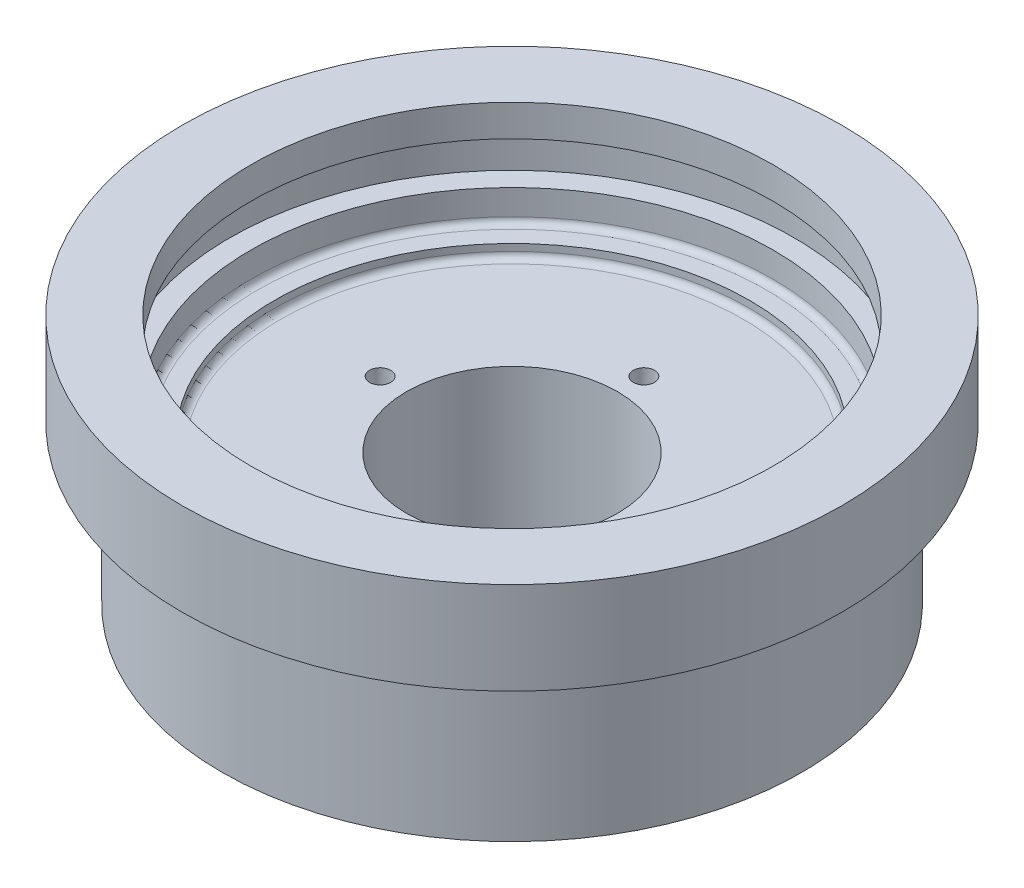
ISO-10303-21;
HEADER;
FILE_DESCRIPTION(('STEP AP214'),'2;1');
FILE_NAME('part.step','',(''),(''),'','','');
FILE_SCHEMA(('AUTOMOTIVE_DESIGN { 1 0 10303 214 1 1 1 1 }'));
ENDSEC;
DATA;
#1=APPLICATION_CONTEXT('core data for automotive mechanical design processes');
#2=APPLICATION_PROTOCOL_DEFINITION('international standard','automotive_design',2000,#1);
#3=PRODUCT_CONTEXT('',#1,'mechanical');
#4=PRODUCT('Part','Part','',(#3));
#5=PRODUCT_RELATED_PRODUCT_CATEGORY('part','',(#4));
#6=PRODUCT_DEFINITION_FORMATION('','',#4);
#7=PRODUCT_DEFINITION_CONTEXT('part definition',#1,'design');
#8=PRODUCT_DEFINITION('design','',#6,#7);
#9=PRODUCT_DEFINITION_SHAPE('','',#8);
#10=(LENGTH_UNIT() NAMED_UNIT(*) SI_UNIT(.MILLI.,.METRE.));
#11=(NAMED_UNIT(*) PLANE_ANGLE_UNIT() SI_UNIT($,.RADIAN.));
#12=(NAMED_UNIT(*) SI_UNIT($,.STERADIAN.) SOLID_ANGLE_UNIT());
#13=UNCERTAINTY_MEASURE_WITH_UNIT(LENGTH_MEASURE(1.E-05),#10,'distance_accuracy_value','');
#14=(GEOMETRIC_REPRESENTATION_CONTEXT(3) GLOBAL_UNCERTAINTY_ASSIGNED_CONTEXT((#13)) GLOBAL_UNIT_ASSIGNED_CONTEXT((#10,
#11,#12)) REPRESENTATION_CONTEXT('',''));
#15=CARTESIAN_POINT('',(0.,0.,0.));
#16=DIRECTION('',(0.,0.,1.));
#17=DIRECTION('',(1.,0.,0.));
#18=AXIS2_PLACEMENT_3D('',#15,#16,#17);
#19=CARTESIAN_POINT('',(0.,88.7095,0.));
#20=DIRECTION('',(0.,1.,0.));
#21=DIRECTION('',(0.,0.,1.));
#22=AXIS2_PLACEMENT_3D('',#19,#20,#21);
#23=CYLINDRICAL_SURFACE('',#22,62.865);
#24=CARTESIAN_POINT('',(0.,0.,0.));
#25=DIRECTION('',(0.,1.,0.));
#26=DIRECTION('',(0.,0.,1.));
#27=AXIS2_PLACEMENT_3D('',#24,#25,#26);
#28=CIRCLE('',#27,62.865);
#29=CARTESIAN_POINT('',(0.,0.,62.865));
#30=VERTEX_POINT('',#29);
#31=EDGE_CURVE('E12',#30,#30,#28,.T.);
#32=ORIENTED_EDGE('',*,*,#31,.T.);
#33=EDGE_LOOP('',(#32));
#34=FACE_BOUND('',#33,.T.);
#35=CARTESIAN_POINT('',(0.,-7.62,0.));
#36=DIRECTION('',(0.,1.,0.));
#37=DIRECTION('',(0.,0.,1.));
#38=AXIS2_PLACEMENT_3D('',#35,#36,#37);
#39=CIRCLE('',#38,62.865);
#40=CARTESIAN_POINT('',(0.,-7.62,62.865));
#41=VERTEX_POINT('',#40);
#42=EDGE_CURVE('E145',#41,#41,#39,.T.);
#43=ORIENTED_EDGE('',*,*,#42,.F.);
#44=EDGE_LOOP('',(#43));
#45=FACE_BOUND('',#44,.T.);
#46=ADVANCED_FACE('F45',(#34,#45),#23,.F.);
#47=CARTESIAN_POINT('',(62.865,0.,0.));
#48=DIRECTION('',(0.,1.,0.));
#49=DIRECTION('',(0.,0.,1.));
#50=AXIS2_PLACEMENT_3D('',#47,#48,#49);
#51=PLANE('',#50);
#52=CARTESIAN_POINT('',(0.,0.,0.));
#53=DIRECTION('',(0.,1.,0.));
#54=DIRECTION('',(0.,0.,1.));
#55=AXIS2_PLACEMENT_3D('',#52,#53,#54);
#56=CIRCLE('',#55,79.375);
#57=CARTESIAN_POINT('',(0.,0.,79.375));
#58=VERTEX_POINT('',#57);
#59=EDGE_CURVE('E52',#58,#58,#56,.T.);
#60=ORIENTED_EDGE('',*,*,#59,.T.);
#61=EDGE_LOOP('',(#60));
#62=FACE_BOUND('',#61,.T.);
#63=ORIENTED_EDGE('',*,*,#31,.F.);
#64=EDGE_LOOP('',(#63));
#65=FACE_BOUND('',#64,.T.);
#66=ADVANCED_FACE('F222',(#62,#65),#51,.T.);
#67=CARTESIAN_POINT('',(0.,88.7095,0.));
#68=DIRECTION('',(0.,1.,0.));
#69=DIRECTION('',(0.,0.,1.));
#70=AXIS2_PLACEMENT_3D('',#67,#68,#69);
#71=CYLINDRICAL_SURFACE('',#70,79.375);
#72=CARTESIAN_POINT('',(0.,-22.225,0.));
#73=DIRECTION('',(0.,1.,0.));
#74=DIRECTION('',(0.,0.,1.));
#75=AXIS2_PLACEMENT_3D('',#72,#73,#74);
#76=CIRCLE('',#75,79.375);
#77=CARTESIAN_POINT('',(0.,-22.225,79.375));
#78=VERTEX_POINT('',#77);
#79=EDGE_CURVE('E59',#78,#78,#76,.T.);
#80=ORIENTED_EDGE('',*,*,#79,.T.);
#81=EDGE_LOOP('',(#80));
#82=FACE_BOUND('',#81,.T.);
#83=ORIENTED_EDGE('',*,*,#59,.F.);
#84=EDGE_LOOP('',(#83));
#85=FACE_BOUND('',#84,.T.);
#86=ADVANCED_FACE('F226',(#82,#85),#71,.T.);
#87=CARTESIAN_POINT('',(79.375,-22.225,0.));
#88=DIRECTION('',(0.,-1.,0.));
#89=DIRECTION('',(0.,0.,-1.));
#90=AXIS2_PLACEMENT_3D('',#87,#88,#89);
#91=PLANE('',#90);
#92=CARTESIAN_POINT('',(0.,-22.225,0.));
#93=DIRECTION('',(0.,1.,0.));
#94=DIRECTION('',(0.,0.,1.));
#95=AXIS2_PLACEMENT_3D('',#92,#93,#94);
#96=CIRCLE('',#95,71.374);
#97=CARTESIAN_POINT('',(0.,-22.225,71.374));
#98=VERTEX_POINT('',#97);
#99=EDGE_CURVE('E66',#98,#98,#96,.T.);
#100=ORIENTED_EDGE('',*,*,#99,.T.);
#101=EDGE_LOOP('',(#100));
#102=FACE_BOUND('',#101,.T.);
#103=ORIENTED_EDGE('',*,*,#79,.F.);
#104=EDGE_LOOP('',(#103));
#105=FACE_BOUND('',#104,.T.);
#106=ADVANCED_FACE('F294',(#102,#105),#91,.T.);
#107=CARTESIAN_POINT('',(0.,-23.749,0.));
#108=DIRECTION('',(0.,1.,0.));
#109=DIRECTION('',(0.,0.,1.));
#110=AXIS2_PLACEMENT_3D('',#107,#108,#109);
#111=TOROIDAL_SURFACE('',#110,71.374,1.524);
#112=ORIENTED_EDGE('',*,*,#99,.F.);
#113=EDGE_LOOP('',(#112));
#114=FACE_BOUND('',#113,.T.);
#115=CARTESIAN_POINT('',(0.,-23.749,0.));
#116=DIRECTION('',(0.,1.,0.));
#117=DIRECTION('',(0.,0.,1.));
#118=AXIS2_PLACEMENT_3D('',#115,#116,#117);
#119=CIRCLE('',#118,69.85);
#120=CARTESIAN_POINT('',(0.,-23.749,69.85));
#121=VERTEX_POINT('',#120);
#122=EDGE_CURVE('E72',#121,#121,#119,.T.);
#123=ORIENTED_EDGE('',*,*,#122,.T.);
#124=EDGE_LOOP('',(#123));
#125=FACE_BOUND('',#124,.T.);
#126=ADVANCED_FACE('F328',(#114,#125),#111,.F.);
#127=CARTESIAN_POINT('',(0.,88.7095,0.));
#128=DIRECTION('',(0.,1.,0.));
#129=DIRECTION('',(0.,0.,1.));
#130=AXIS2_PLACEMENT_3D('',#127,#128,#129);
#131=CYLINDRICAL_SURFACE('',#130,69.85);
#132=CARTESIAN_POINT('',(0.,-60.325,0.));
#133=DIRECTION('',(0.,1.,0.));
#134=DIRECTION('',(0.,0.,1.));
#135=AXIS2_PLACEMENT_3D('',#132,#133,#134);
#136=CIRCLE('',#135,69.85);
#137=CARTESIAN_POINT('',(0.,-60.325,69.85));
#138=VERTEX_POINT('',#137);
#139=EDGE_CURVE('E76',#138,#138,#136,.T.);
#140=ORIENTED_EDGE('',*,*,#139,.T.);
#141=EDGE_LOOP('',(#140));
#142=FACE_BOUND('',#141,.T.);
#143=ORIENTED_EDGE('',*,*,#122,.F.);
#144=EDGE_LOOP('',(#143));
#145=FACE_BOUND('',#144,.T.);
#146=ADVANCED_FACE('F319',(#142,#145),#131,.T.);
#147=CARTESIAN_POINT('',(64.5159999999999,-60.325,0.));
#148=DIRECTION('',(0.,1.,0.));
#149=DIRECTION('',(0.,0.,1.));
#150=AXIS2_PLACEMENT_3D('',#147,#148,#149);
#151=PLANE('',#150);
#152=ORIENTED_EDGE('',*,*,#139,.F.);
#153=EDGE_LOOP('',(#152));
#154=FACE_BOUND('',#153,.T.);
#155=CARTESIAN_POINT('',(0.,-60.325,0.));
#156=DIRECTION('',(0.,1.,0.));
#157=DIRECTION('',(0.,0.,1.));
#158=AXIS2_PLACEMENT_3D('',#155,#156,#157);
#159=CIRCLE('',#158,64.5159999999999);
#160=CARTESIAN_POINT('',(0.,-60.325,64.5159999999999));
#161=VERTEX_POINT('',#160);
#162=EDGE_CURVE('E80',#161,#161,#159,.T.);
#163=ORIENTED_EDGE('',*,*,#162,.T.);
#164=EDGE_LOOP('',(#163));
#165=FACE_BOUND('',#164,.T.);
#166=ADVANCED_FACE('F308',(#154,#165),#151,.F.);
#167=CARTESIAN_POINT('',(0.,-61.849,0.));
#168=DIRECTION('',(0.,1.,0.));
#169=DIRECTION('',(0.,0.,1.));
#170=AXIS2_PLACEMENT_3D('',#167,#168,#169);
#171=TOROIDAL_SURFACE('',#170,64.5159999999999,1.52399999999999);
#172=CARTESIAN_POINT('',(0.,-61.849,0.));
#173=DIRECTION('',(0.,1.,0.));
#174=DIRECTION('',(0.,0.,1.));
#175=AXIS2_PLACEMENT_3D('',#172,#173,#174);
#176=CIRCLE('',#175,62.992);
#177=CARTESIAN_POINT('',(0.,-61.849,62.992));
#178=VERTEX_POINT('',#177);
#179=EDGE_CURVE('E84',#178,#178,#176,.T.);
#180=ORIENTED_EDGE('',*,*,#179,.T.);
#181=EDGE_LOOP('',(#180));
#182=FACE_BOUND('',#181,.T.);
#183=ORIENTED_EDGE('',*,*,#162,.F.);
#184=EDGE_LOOP('',(#183));
#185=FACE_BOUND('',#184,.T.);
#186=ADVANCED_FACE('F303',(#182,#185),#171,.F.);
#187=CARTESIAN_POINT('',(0.,88.7095,0.));
#188=DIRECTION('',(0.,1.,0.));
#189=DIRECTION('',(0.,0.,1.));
#190=AXIS2_PLACEMENT_3D('',#187,#188,#189);
#191=CYLINDRICAL_SURFACE('',#190,62.992);
#192=ORIENTED_EDGE('',*,*,#179,.F.);
#193=EDGE_LOOP('',(#192));
#194=FACE_BOUND('',#193,.T.);
#195=CARTESIAN_POINT('',(0.,-63.5,0.));
#196=DIRECTION('',(0.,1.,0.));
#197=DIRECTION('',(0.,0.,1.));
#198=AXIS2_PLACEMENT_3D('',#195,#196,#197);
#199=CIRCLE('',#198,62.9919999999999);
#200=CARTESIAN_POINT('',(0.,-63.5,62.9919999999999));
#201=VERTEX_POINT('',#200);
#202=EDGE_CURVE('E88',#201,#201,#199,.T.);
#203=ORIENTED_EDGE('',*,*,#202,.T.);
#204=EDGE_LOOP('',(#203));
#205=FACE_BOUND('',#204,.T.);
#206=ADVANCED_FACE('F307',(#194,#205),#191,.T.);
#207=CARTESIAN_POINT('',(41.275,-63.5,0.));
#208=DIRECTION('',(0.,1.,0.));
#209=DIRECTION('',(0.,0.,1.));
#210=AXIS2_PLACEMENT_3D('',#207,#208,#209);
#211=PLANE('',#210);
#212=ORIENTED_EDGE('',*,*,#202,.F.);
#213=EDGE_LOOP('',(#212));
#214=FACE_BOUND('',#213,.T.);
#215=CARTESIAN_POINT('',(0.,-63.5,0.));
#216=DIRECTION('',(0.,1.,0.));
#217=DIRECTION('',(0.,0.,1.));
#218=AXIS2_PLACEMENT_3D('',#215,#216,#217);
#219=CIRCLE('',#218,41.275);
#220=CARTESIAN_POINT('',(0.,-63.5,41.275));
#221=VERTEX_POINT('',#220);
#222=EDGE_CURVE('E92',#221,#221,#219,.T.);
#223=ORIENTED_EDGE('',*,*,#222,.T.);
#224=EDGE_LOOP('',(#223));
#225=FACE_BOUND('',#224,.T.);
#226=ADVANCED_FACE('F464',(#214,#225),#211,.F.);
#227=CARTESIAN_POINT('',(0.,88.7095,0.));
#228=DIRECTION('',(0.,1.,0.));
#229=DIRECTION('',(0.,0.,1.));
#230=AXIS2_PLACEMENT_3D('',#227,#228,#229);
#231=CYLINDRICAL_SURFACE('',#230,41.275);
#232=ORIENTED_EDGE('',*,*,#222,.F.);
#233=EDGE_LOOP('',(#232));
#234=FACE_BOUND('',#233,.T.);
#235=CARTESIAN_POINT('',(0.,-60.6806,0.));
#236=DIRECTION('',(0.,1.,0.));
#237=DIRECTION('',(0.,0.,1.));
#238=AXIS2_PLACEMENT_3D('',#235,#236,#237);
#239=CIRCLE('',#238,41.275);
#240=CARTESIAN_POINT('',(0.,-60.6806,41.275));
#241=VERTEX_POINT('',#240);
#242=EDGE_CURVE('E95',#241,#241,#239,.T.);
#243=ORIENTED_EDGE('',*,*,#242,.T.);
#244=EDGE_LOOP('',(#243));
#245=FACE_BOUND('',#244,.T.);
#246=ADVANCED_FACE('F355',(#234,#245),#231,.F.);
#247=CARTESIAN_POINT('',(36.5252,-60.6806,0.));
#248=DIRECTION('',(0.,1.,0.));
#249=DIRECTION('',(0.,0.,1.));
#250=AXIS2_PLACEMENT_3D('',#247,#248,#249);
#251=PLANE('',#250);
#252=ORIENTED_EDGE('',*,*,#242,.F.);
#253=EDGE_LOOP('',(#252));
#254=FACE_BOUND('',#253,.T.);
#255=CARTESIAN_POINT('',(0.,-60.6806,0.));
#256=DIRECTION('',(0.,1.,0.));
#257=DIRECTION('',(0.,0.,1.));
#258=AXIS2_PLACEMENT_3D('',#255,#256,#257);
#259=CIRCLE('',#258,36.5252);
#260=CARTESIAN_POINT('',(0.,-60.6806,36.5252));
#261=VERTEX_POINT('',#260);
#262=EDGE_CURVE('E99',#261,#261,#259,.T.);
#263=ORIENTED_EDGE('',*,*,#262,.T.);
#264=EDGE_LOOP('',(#263));
#265=FACE_BOUND('',#264,.T.);
#266=ADVANCED_FACE('F218',(#254,#265),#251,.F.);
#267=CARTESIAN_POINT('',(0.,88.7095,0.));
#268=DIRECTION('',(0.,1.,0.));
#269=DIRECTION('',(0.,0.,1.));
#270=AXIS2_PLACEMENT_3D('',#267,#268,#269);
#271=CYLINDRICAL_SURFACE('',#270,36.5252);
#272=CARTESIAN_POINT('',(0.,-63.5,0.));
#273=DIRECTION('',(0.,1.,0.));
#274=DIRECTION('',(0.,0.,1.));
#275=AXIS2_PLACEMENT_3D('',#272,#273,#274);
#276=CIRCLE('',#275,36.5252);
#277=CARTESIAN_POINT('',(0.,-63.5,36.5252));
#278=VERTEX_POINT('',#277);
#279=EDGE_CURVE('E103',#278,#278,#276,.T.);
#280=ORIENTED_EDGE('',*,*,#279,.T.);
#281=EDGE_LOOP('',(#280));
#282=FACE_BOUND('',#281,.T.);
#283=ORIENTED_EDGE('',*,*,#262,.F.);
#284=EDGE_LOOP('',(#283));
#285=FACE_BOUND('',#284,.T.);
#286=ADVANCED_FACE('F213',(#282,#285),#271,.T.);
#287=CARTESIAN_POINT('',(25.4,-63.5,0.));
#288=DIRECTION('',(0.,1.,0.));
#289=DIRECTION('',(0.,0.,1.));
#290=AXIS2_PLACEMENT_3D('',#287,#288,#289);
#291=PLANE('',#290);
#292=CARTESIAN_POINT('',(31.75,-63.5,3.32563790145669E-13));
#293=DIRECTION('',(0.,1.,0.));
#294=DIRECTION('',(1.,0.,0.));
#295=AXIS2_PLACEMENT_3D('',#292,#293,#294);
#296=CIRCLE('',#295,2.54);
#297=CARTESIAN_POINT('',(34.29,-63.5,3.59168893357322E-13));
#298=VERTEX_POINT('',#297);
#299=EDGE_CURVE('E176',#298,#298,#296,.T.);
#300=ORIENTED_EDGE('',*,*,#299,.T.);
#301=EDGE_LOOP('',(#300));
#302=FACE_BOUND('',#301,.T.);
#303=CARTESIAN_POINT('',(2.21709193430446E-13,-63.5,-31.75));
#304=DIRECTION('',(0.,1.,0.));
#305=DIRECTION('',(0.,0.,-1.));
#306=AXIS2_PLACEMENT_3D('',#303,#304,#305);
#307=CIRCLE('',#306,2.54);
#308=CARTESIAN_POINT('',(2.39445928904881E-13,-63.5,-34.29));
#309=VERTEX_POINT('',#308);
#310=EDGE_CURVE('E168',#309,#309,#307,.T.);
#311=ORIENTED_EDGE('',*,*,#310,.T.);
#312=EDGE_LOOP('',(#311));
#313=FACE_BOUND('',#312,.T.);
#314=CARTESIAN_POINT('',(-31.75,-63.5,-1.10854596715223E-13));
#315=DIRECTION('',(0.,1.,0.));
#316=DIRECTION('',(-1.,0.,0.));
#317=AXIS2_PLACEMENT_3D('',#314,#315,#316);
#318=CIRCLE('',#317,2.54);
#319=CARTESIAN_POINT('',(-34.29,-63.5,-1.19722964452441E-13));
#320=VERTEX_POINT('',#319);
#321=EDGE_CURVE('E161',#320,#320,#318,.T.);
#322=ORIENTED_EDGE('',*,*,#321,.T.);
#323=EDGE_LOOP('',(#322));
#324=FACE_BOUND('',#323,.T.);
#325=CARTESIAN_POINT('',(0.,-63.5,31.75));
#326=DIRECTION('',(0.,1.,0.));
#327=DIRECTION('',(0.,0.,1.));
#328=AXIS2_PLACEMENT_3D('',#325,#326,#327);
#329=CIRCLE('',#328,2.54);
#330=CARTESIAN_POINT('',(0.,-63.5,34.29));
#331=VERTEX_POINT('',#330);
#332=EDGE_CURVE('E149',#331,#331,#329,.T.);
#333=ORIENTED_EDGE('',*,*,#332,.T.);
#334=EDGE_LOOP('',(#333));
#335=FACE_BOUND('',#334,.T.);
#336=ORIENTED_EDGE('',*,*,#279,.F.);
#337=EDGE_LOOP('',(#336));
#338=FACE_BOUND('',#337,.T.);
#339=CARTESIAN_POINT('',(0.,-63.5,0.));
#340=DIRECTION('',(0.,1.,0.));
#341=DIRECTION('',(0.,0.,1.));
#342=AXIS2_PLACEMENT_3D('',#339,#340,#341);
#343=CIRCLE('',#342,25.4);
#344=CARTESIAN_POINT('',(0.,-63.5,25.4));
#345=VERTEX_POINT('',#344);
#346=EDGE_CURVE('E107',#345,#345,#343,.T.);
#347=ORIENTED_EDGE('',*,*,#346,.T.);
#348=EDGE_LOOP('',(#347));
#349=FACE_BOUND('',#348,.T.);
#350=ADVANCED_FACE('F181',(#302,#313,#324,#335,#338,#349),#291,.F.);
#351=CARTESIAN_POINT('',(0.,88.7095,0.));
#352=DIRECTION('',(0.,1.,0.));
#353=DIRECTION('',(0.,0.,1.));
#354=AXIS2_PLACEMENT_3D('',#351,#352,#353);
#355=CYLINDRICAL_SURFACE('',#354,25.4);
#356=CARTESIAN_POINT('',(0.,-28.575,0.));
#357=DIRECTION('',(0.,1.,0.));
#358=DIRECTION('',(0.,0.,1.));
#359=AXIS2_PLACEMENT_3D('',#356,#357,#358);
#360=CIRCLE('',#359,25.4);
#361=CARTESIAN_POINT('',(0.,-28.575,25.4));
#362=VERTEX_POINT('',#361);
#363=EDGE_CURVE('E110',#362,#362,#360,.T.);
#364=ORIENTED_EDGE('',*,*,#363,.T.);
#365=EDGE_LOOP('',(#364));
#366=FACE_BOUND('',#365,.T.);
#367=ORIENTED_EDGE('',*,*,#346,.F.);
#368=EDGE_LOOP('',(#367));
#369=FACE_BOUND('',#368,.T.);
#370=ADVANCED_FACE('F195',(#366,#369),#355,.F.);
#371=CARTESIAN_POINT('',(25.4,-28.575,0.));
#372=DIRECTION('',(0.,1.,0.));
#373=DIRECTION('',(0.,0.,1.));
#374=AXIS2_PLACEMENT_3D('',#371,#372,#373);
#375=PLANE('',#374);
#376=CARTESIAN_POINT('',(31.75,-28.575,3.32563790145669E-13));
#377=DIRECTION('',(0.,1.,0.));
#378=DIRECTION('',(1.,0.,0.));
#379=AXIS2_PLACEMENT_3D('',#376,#377,#378);
#380=CIRCLE('',#379,2.54);
#381=CARTESIAN_POINT('',(34.29,-28.575,3.59168893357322E-13));
#382=VERTEX_POINT('',#381);
#383=EDGE_CURVE('E172',#382,#382,#380,.T.);
#384=ORIENTED_EDGE('',*,*,#383,.F.);
#385=EDGE_LOOP('',(#384));
#386=FACE_BOUND('',#385,.T.);
#387=CARTESIAN_POINT('',(2.21709193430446E-13,-28.575,-31.75));
#388=DIRECTION('',(0.,1.,0.));
#389=DIRECTION('',(0.,0.,-1.));
#390=AXIS2_PLACEMENT_3D('',#387,#388,#389);
#391=CIRCLE('',#390,2.54);
#392=CARTESIAN_POINT('',(2.39445928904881E-13,-28.575,-34.29));
#393=VERTEX_POINT('',#392);
#394=EDGE_CURVE('E165',#393,#393,#391,.T.);
#395=ORIENTED_EDGE('',*,*,#394,.F.);
#396=EDGE_LOOP('',(#395));
#397=FACE_BOUND('',#396,.T.);
#398=CARTESIAN_POINT('',(-31.75,-28.575,-1.10854596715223E-13));
#399=DIRECTION('',(0.,1.,0.));
#400=DIRECTION('',(-1.,0.,0.));
#401=AXIS2_PLACEMENT_3D('',#398,#399,#400);
#402=CIRCLE('',#401,2.54);
#403=CARTESIAN_POINT('',(-34.29,-28.575,-1.19722964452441E-13));
#404=VERTEX_POINT('',#403);
#405=EDGE_CURVE('E157',#404,#404,#402,.T.);
#406=ORIENTED_EDGE('',*,*,#405,.F.);
#407=EDGE_LOOP('',(#406));
#408=FACE_BOUND('',#407,.T.);
#409=CARTESIAN_POINT('',(0.,-28.575,31.75));
#410=DIRECTION('',(0.,1.,0.));
#411=DIRECTION('',(0.,0.,1.));
#412=AXIS2_PLACEMENT_3D('',#409,#410,#411);
#413=CIRCLE('',#412,2.54);
#414=CARTESIAN_POINT('',(0.,-28.575,34.29));
#415=VERTEX_POINT('',#414);
#416=EDGE_CURVE('E153',#415,#415,#413,.T.);
#417=ORIENTED_EDGE('',*,*,#416,.F.);
#418=EDGE_LOOP('',(#417));
#419=FACE_BOUND('',#418,.T.);
#420=CARTESIAN_POINT('',(0.,-28.575,0.));
#421=DIRECTION('',(0.,1.,0.));
#422=DIRECTION('',(0.,0.,1.));
#423=AXIS2_PLACEMENT_3D('',#420,#421,#422);
#424=CIRCLE('',#423,55.626);
#425=CARTESIAN_POINT('',(0.,-28.575,55.626));
#426=VERTEX_POINT('',#425);
#427=EDGE_CURVE('E114',#426,#426,#424,.T.);
#428=ORIENTED_EDGE('',*,*,#427,.T.);
#429=EDGE_LOOP('',(#428));
#430=FACE_BOUND('',#429,.T.);
#431=ORIENTED_EDGE('',*,*,#363,.F.);
#432=EDGE_LOOP('',(#431));
#433=FACE_BOUND('',#432,.T.);
#434=ADVANCED_FACE('F191',(#386,#397,#408,#419,#430,#433),#375,.T.);
#435=CARTESIAN_POINT('',(0.,-27.051,0.));
#436=DIRECTION('',(0.,1.,0.));
#437=DIRECTION('',(0.,0.,1.));
#438=AXIS2_PLACEMENT_3D('',#435,#436,#437);
#439=TOROIDAL_SURFACE('',#438,55.626,1.524);
#440=ORIENTED_EDGE('',*,*,#427,.F.);
#441=EDGE_LOOP('',(#440));
#442=FACE_BOUND('',#441,.T.);
#443=CARTESIAN_POINT('',(0.,-27.051,0.));
#444=DIRECTION('',(0.,1.,0.));
#445=DIRECTION('',(0.,0.,1.));
#446=AXIS2_PLACEMENT_3D('',#443,#444,#445);
#447=CIRCLE('',#446,57.15);
#448=CARTESIAN_POINT('',(0.,-27.051,57.15));
#449=VERTEX_POINT('',#448);
#450=EDGE_CURVE('E117',#449,#449,#447,.T.);
#451=ORIENTED_EDGE('',*,*,#450,.T.);
#452=EDGE_LOOP('',(#451));
#453=FACE_BOUND('',#452,.T.);
#454=ADVANCED_FACE('F194',(#442,#453),#439,.F.);
#455=CARTESIAN_POINT('',(0.,88.7095,0.));
#456=DIRECTION('',(0.,1.,0.));
#457=DIRECTION('',(0.,0.,1.));
#458=AXIS2_PLACEMENT_3D('',#455,#456,#457);
#459=CYLINDRICAL_SURFACE('',#458,57.15);
#460=CARTESIAN_POINT('',(0.,-25.4,0.));
#461=DIRECTION('',(0.,1.,0.));
#462=DIRECTION('',(0.,0.,1.));
#463=AXIS2_PLACEMENT_3D('',#460,#461,#462);
#464=CIRCLE('',#463,57.15);
#465=CARTESIAN_POINT('',(0.,-25.4,57.15));
#466=VERTEX_POINT('',#465);
#467=EDGE_CURVE('E121',#466,#466,#464,.T.);
#468=ORIENTED_EDGE('',*,*,#467,.T.);
#469=EDGE_LOOP('',(#468));
#470=FACE_BOUND('',#469,.T.);
#471=ORIENTED_EDGE('',*,*,#450,.F.);
#472=EDGE_LOOP('',(#471));
#473=FACE_BOUND('',#472,.T.);
#474=ADVANCED_FACE('F263',(#470,#473),#459,.F.);
#475=CARTESIAN_POINT('',(57.15,-25.4,0.));
#476=DIRECTION('',(0.,1.,0.));
#477=DIRECTION('',(0.,0.,1.));
#478=AXIS2_PLACEMENT_3D('',#475,#476,#477);
#479=PLANE('',#478);
#480=CARTESIAN_POINT('',(0.,-25.4,0.));
#481=DIRECTION('',(0.,1.,0.));
#482=DIRECTION('',(0.,0.,1.));
#483=AXIS2_PLACEMENT_3D('',#480,#481,#482);
#484=CIRCLE('',#483,61.341);
#485=CARTESIAN_POINT('',(0.,-25.4,61.341));
#486=VERTEX_POINT('',#485);
#487=EDGE_CURVE('E125',#486,#486,#484,.T.);
#488=ORIENTED_EDGE('',*,*,#487,.T.);
#489=EDGE_LOOP('',(#488));
#490=FACE_BOUND('',#489,.T.);
#491=ORIENTED_EDGE('',*,*,#467,.F.);
#492=EDGE_LOOP('',(#491));
#493=FACE_BOUND('',#492,.T.);
#494=ADVANCED_FACE('F257',(#490,#493),#479,.T.);
#495=CARTESIAN_POINT('',(0.,-23.876,0.));
#496=DIRECTION('',(0.,1.,0.));
#497=DIRECTION('',(0.,0.,1.));
#498=AXIS2_PLACEMENT_3D('',#495,#496,#497);
#499=TOROIDAL_SURFACE('',#498,61.341,1.524);
#500=ORIENTED_EDGE('',*,*,#487,.F.);
#501=EDGE_LOOP('',(#500));
#502=FACE_BOUND('',#501,.T.);
#503=CARTESIAN_POINT('',(0.,-23.876,0.));
#504=DIRECTION('',(0.,1.,0.));
#505=DIRECTION('',(0.,0.,1.));
#506=AXIS2_PLACEMENT_3D('',#503,#504,#505);
#507=CIRCLE('',#506,62.865);
#508=CARTESIAN_POINT('',(0.,-23.876,62.865));
#509=VERTEX_POINT('',#508);
#510=EDGE_CURVE('E129',#509,#509,#507,.T.);
#511=ORIENTED_EDGE('',*,*,#510,.T.);
#512=EDGE_LOOP('',(#511));
#513=FACE_BOUND('',#512,.T.);
#514=ADVANCED_FACE('F252',(#502,#513),#499,.F.);
#515=CARTESIAN_POINT('',(0.,88.7095,0.));
#516=DIRECTION('',(0.,1.,0.));
#517=DIRECTION('',(0.,0.,1.));
#518=AXIS2_PLACEMENT_3D('',#515,#516,#517);
#519=CYLINDRICAL_SURFACE('',#518,62.865);
#520=CARTESIAN_POINT('',(0.,-17.78,0.));
#521=DIRECTION('',(0.,1.,0.));
#522=DIRECTION('',(0.,0.,1.));
#523=AXIS2_PLACEMENT_3D('',#520,#521,#522);
#524=CIRCLE('',#523,62.865);
#525=CARTESIAN_POINT('',(0.,-17.78,62.865));
#526=VERTEX_POINT('',#525);
#527=EDGE_CURVE('E133',#526,#526,#524,.T.);
#528=ORIENTED_EDGE('',*,*,#527,.T.);
#529=EDGE_LOOP('',(#528));
#530=FACE_BOUND('',#529,.T.);
#531=ORIENTED_EDGE('',*,*,#510,.F.);
#532=EDGE_LOOP('',(#531));
#533=FACE_BOUND('',#532,.T.);
#534=ADVANCED_FACE('F246',(#530,#533),#519,.F.);
#535=CARTESIAN_POINT('',(62.865,-17.78,0.));
#536=DIRECTION('',(0.,1.,0.));
#537=DIRECTION('',(0.,0.,1.));
#538=AXIS2_PLACEMENT_3D('',#535,#536,#537);
#539=PLANE('',#538);
#540=CARTESIAN_POINT('',(0.,-17.78,0.));
#541=DIRECTION('',(0.,1.,0.));
#542=DIRECTION('',(0.,0.,1.));
#543=AXIS2_PLACEMENT_3D('',#540,#541,#542);
#544=CIRCLE('',#543,67.945);
#545=CARTESIAN_POINT('',(0.,-17.78,67.945));
#546=VERTEX_POINT('',#545);
#547=EDGE_CURVE('E137',#546,#546,#544,.T.);
#548=ORIENTED_EDGE('',*,*,#547,.T.);
#549=EDGE_LOOP('',(#548));
#550=FACE_BOUND('',#549,.T.);
#551=ORIENTED_EDGE('',*,*,#527,.F.);
#552=EDGE_LOOP('',(#551));
#553=FACE_BOUND('',#552,.T.);
#554=ADVANCED_FACE('F240',(#550,#553),#539,.T.);
#555=CARTESIAN_POINT('',(0.,88.7095,0.));
#556=DIRECTION('',(0.,1.,0.));
#557=DIRECTION('',(0.,0.,1.));
#558=AXIS2_PLACEMENT_3D('',#555,#556,#557);
#559=CYLINDRICAL_SURFACE('',#558,67.945);
#560=CARTESIAN_POINT('',(0.,-7.62,0.));
#561=DIRECTION('',(0.,1.,0.));
#562=DIRECTION('',(0.,0.,1.));
#563=AXIS2_PLACEMENT_3D('',#560,#561,#562);
#564=CIRCLE('',#563,67.945);
#565=CARTESIAN_POINT('',(0.,-7.62,67.945));
#566=VERTEX_POINT('',#565);
#567=EDGE_CURVE('E141',#566,#566,#564,.T.);
#568=ORIENTED_EDGE('',*,*,#567,.T.);
#569=EDGE_LOOP('',(#568));
#570=FACE_BOUND('',#569,.T.);
#571=ORIENTED_EDGE('',*,*,#547,.F.);
#572=EDGE_LOOP('',(#571));
#573=FACE_BOUND('',#572,.T.);
#574=ADVANCED_FACE('F234',(#570,#573),#559,.F.);
#575=CARTESIAN_POINT('',(67.945,-7.62,0.));
#576=DIRECTION('',(0.,-1.,0.));
#577=DIRECTION('',(0.,0.,-1.));
#578=AXIS2_PLACEMENT_3D('',#575,#576,#577);
#579=PLANE('',#578);
#580=ORIENTED_EDGE('',*,*,#42,.T.);
#581=EDGE_LOOP('',(#580));
#582=FACE_BOUND('',#581,.T.);
#583=ORIENTED_EDGE('',*,*,#567,.F.);
#584=EDGE_LOOP('',(#583));
#585=FACE_BOUND('',#584,.T.);
#586=ADVANCED_FACE('F230',(#582,#585),#579,.T.);
#587=CARTESIAN_POINT('',(0.,-63.5,31.75));
#588=DIRECTION('',(0.,1.,0.));
#589=DIRECTION('',(0.,0.,1.));
#590=AXIS2_PLACEMENT_3D('',#587,#588,#589);
#591=CYLINDRICAL_SURFACE('',#590,2.54);
#592=ORIENTED_EDGE('',*,*,#332,.F.);
#593=EDGE_LOOP('',(#592));
#594=FACE_BOUND('',#593,.T.);
#595=ORIENTED_EDGE('',*,*,#416,.T.);
#596=EDGE_LOOP('',(#595));
#597=FACE_BOUND('',#596,.T.);
#598=ADVANCED_FACE('F233',(#594,#597),#591,.F.);
#599=CARTESIAN_POINT('',(-31.75,-63.5,-1.10854596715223E-13));
#600=DIRECTION('',(0.,1.,0.));
#601=DIRECTION('',(-1.,0.,0.));
#602=AXIS2_PLACEMENT_3D('',#599,#600,#601);
#603=CYLINDRICAL_SURFACE('',#602,2.54);
#604=ORIENTED_EDGE('',*,*,#321,.F.);
#605=EDGE_LOOP('',(#604));
#606=FACE_BOUND('',#605,.T.);
#607=ORIENTED_EDGE('',*,*,#405,.T.);
#608=EDGE_LOOP('',(#607));
#609=FACE_BOUND('',#608,.T.);
#610=ADVANCED_FACE('F416',(#606,#609),#603,.F.);
#611=CARTESIAN_POINT('',(2.21709193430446E-13,-63.5,-31.75));
#612=DIRECTION('',(0.,1.,0.));
#613=DIRECTION('',(0.,0.,-1.));
#614=AXIS2_PLACEMENT_3D('',#611,#612,#613);
#615=CYLINDRICAL_SURFACE('',#614,2.54);
#616=ORIENTED_EDGE('',*,*,#310,.F.);
#617=EDGE_LOOP('',(#616));
#618=FACE_BOUND('',#617,.T.);
#619=ORIENTED_EDGE('',*,*,#394,.T.);
#620=EDGE_LOOP('',(#619));
#621=FACE_BOUND('',#620,.T.);
#622=ADVANCED_FACE('F187',(#618,#621),#615,.F.);
#623=CARTESIAN_POINT('',(31.75,-63.5,3.32563790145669E-13));
#624=DIRECTION('',(0.,1.,0.));
#625=DIRECTION('',(1.,0.,0.));
#626=AXIS2_PLACEMENT_3D('',#623,#624,#625);
#627=CYLINDRICAL_SURFACE('',#626,2.54);
#628=ORIENTED_EDGE('',*,*,#299,.F.);
#629=EDGE_LOOP('',(#628));
#630=FACE_BOUND('',#629,.T.);
#631=ORIENTED_EDGE('',*,*,#383,.T.);
#632=EDGE_LOOP('',(#631));
#633=FACE_BOUND('',#632,.T.);
#634=ADVANCED_FACE('F184',(#630,#633),#627,.F.);
#635=CLOSED_SHELL('',(#46,#66,#86,#106,#126,#146,#166,#186,#206,#226,#246,#266,#286,#350,#370,
#434,#454,#474,#494,#514,#534,#554,#574,#586,#598,#610,#622,#634));
#636=MANIFOLD_SOLID_BREP('B2',#635);
#637=ADVANCED_BREP_SHAPE_REPRESENTATION('',(#18,#636),#14);
#638=SHAPE_DEFINITION_REPRESENTATION(#9,#637);
ENDSEC;
END-ISO-10303-21;
